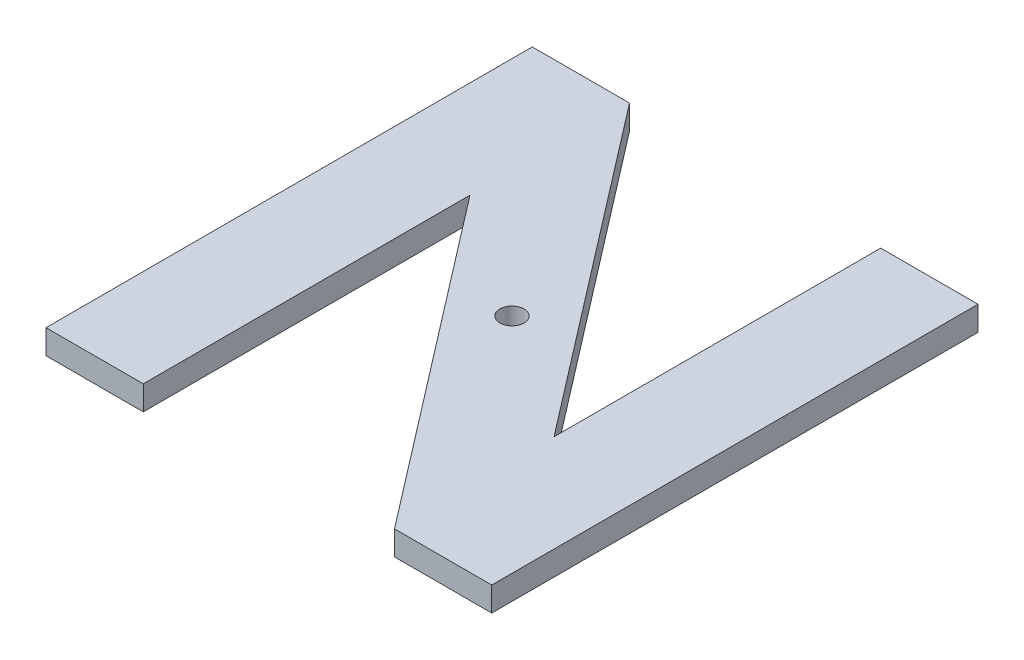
ISO-10303-21;
HEADER;
FILE_DESCRIPTION(('STEP AP214'),'2;1');
FILE_NAME('part.step','',(''),(''),'','','');
FILE_SCHEMA(('AUTOMOTIVE_DESIGN { 1 0 10303 214 1 1 1 1 }'));
ENDSEC;
DATA;
#1=APPLICATION_CONTEXT('core data for automotive mechanical design processes');
#2=APPLICATION_PROTOCOL_DEFINITION('international standard','automotive_design',2000,#1);
#3=PRODUCT_CONTEXT('',#1,'mechanical');
#4=PRODUCT('Part','Part','',(#3));
#5=PRODUCT_RELATED_PRODUCT_CATEGORY('part','',(#4));
#6=PRODUCT_DEFINITION_FORMATION('','',#4);
#7=PRODUCT_DEFINITION_CONTEXT('part definition',#1,'design');
#8=PRODUCT_DEFINITION('design','',#6,#7);
#9=PRODUCT_DEFINITION_SHAPE('','',#8);
#10=(LENGTH_UNIT() NAMED_UNIT(*) SI_UNIT(.MILLI.,.METRE.));
#11=(NAMED_UNIT(*) PLANE_ANGLE_UNIT() SI_UNIT($,.RADIAN.));
#12=(NAMED_UNIT(*) SI_UNIT($,.STERADIAN.) SOLID_ANGLE_UNIT());
#13=UNCERTAINTY_MEASURE_WITH_UNIT(LENGTH_MEASURE(1.E-05),#10,'distance_accuracy_value','');
#14=(GEOMETRIC_REPRESENTATION_CONTEXT(3) GLOBAL_UNCERTAINTY_ASSIGNED_CONTEXT((#13)) GLOBAL_UNIT_ASSIGNED_CONTEXT((#10,
#11,#12)) REPRESENTATION_CONTEXT('',''));
#15=CARTESIAN_POINT('',(0.,0.,0.));
#16=DIRECTION('',(0.,0.,1.));
#17=DIRECTION('',(1.,0.,0.));
#18=AXIS2_PLACEMENT_3D('',#15,#16,#17);
#19=CARTESIAN_POINT('',(0.,3.,-60.));
#20=DIRECTION('',(0.,-1.,0.));
#21=DIRECTION('',(0.,0.,-1.));
#22=AXIS2_PLACEMENT_3D('',#19,#20,#21);
#23=PLANE('',#22);
#24=DIRECTION('',(0.,0.,1.));
#25=VECTOR('',#24,1.);
#26=CARTESIAN_POINT('',(0.,3.,0.));
#27=LINE('',#26,#25);
#28=CARTESIAN_POINT('',(0.,3.,-60.));
#29=VERTEX_POINT('',#28);
#30=CARTESIAN_POINT('',(0.,3.,0.));
#31=VERTEX_POINT('',#30);
#32=EDGE_CURVE('E148',#29,#31,#27,.T.);
#33=ORIENTED_EDGE('',*,*,#32,.T.);
#34=DIRECTION('',(1.,0.,0.));
#35=VECTOR('',#34,1.);
#36=CARTESIAN_POINT('',(0.,3.,0.));
#37=LINE('',#36,#35);
#38=CARTESIAN_POINT('',(12.,3.,0.));
#39=VERTEX_POINT('',#38);
#40=EDGE_CURVE('E121',#31,#39,#37,.T.);
#41=ORIENTED_EDGE('',*,*,#40,.T.);
#42=DIRECTION('',(0.,0.,-1.));
#43=VECTOR('',#42,1.);
#44=CARTESIAN_POINT('',(12.,3.,0.));
#45=LINE('',#44,#43);
#46=CARTESIAN_POINT('',(12.,3.,-40.314144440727));
#47=VERTEX_POINT('',#46);
#48=EDGE_CURVE('E151',#39,#47,#45,.T.);
#49=ORIENTED_EDGE('',*,*,#48,.T.);
#50=DIRECTION('',(0.609576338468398,0.,0.792727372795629));
#51=VECTOR('',#50,1.);
#52=CARTESIAN_POINT('',(43.,3.,0.));
#53=LINE('',#52,#51);
#54=CARTESIAN_POINT('',(43.,3.,0.));
#55=VERTEX_POINT('',#54);
#56=EDGE_CURVE('E153',#47,#55,#53,.T.);
#57=ORIENTED_EDGE('',*,*,#56,.T.);
#58=DIRECTION('',(1.,0.,0.));
#59=VECTOR('',#58,1.);
#60=CARTESIAN_POINT('',(43.,3.,0.));
#61=LINE('',#60,#59);
#62=CARTESIAN_POINT('',(55.,3.,0.));
#63=VERTEX_POINT('',#62);
#64=EDGE_CURVE('E155',#55,#63,#61,.T.);
#65=ORIENTED_EDGE('',*,*,#64,.T.);
#66=DIRECTION('',(0.,0.,-1.));
#67=VECTOR('',#66,1.);
#68=CARTESIAN_POINT('',(55.,3.,0.));
#69=LINE('',#68,#67);
#70=CARTESIAN_POINT('',(55.,3.,-60.));
#71=VERTEX_POINT('',#70);
#72=EDGE_CURVE('E157',#63,#71,#69,.T.);
#73=ORIENTED_EDGE('',*,*,#72,.T.);
#74=DIRECTION('',(-1.,0.,0.));
#75=VECTOR('',#74,1.);
#76=CARTESIAN_POINT('',(43.,3.,-60.));
#77=LINE('',#76,#75);
#78=CARTESIAN_POINT('',(43.,3.,-60.));
#79=VERTEX_POINT('',#78);
#80=EDGE_CURVE('E159',#71,#79,#77,.T.);
#81=ORIENTED_EDGE('',*,*,#80,.T.);
#82=DIRECTION('',(0.,0.,1.));
#83=VECTOR('',#82,1.);
#84=CARTESIAN_POINT('',(43.,3.,-19.685855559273));
#85=LINE('',#84,#83);
#86=CARTESIAN_POINT('',(43.,3.,-19.685855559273));
#87=VERTEX_POINT('',#86);
#88=EDGE_CURVE('E161',#79,#87,#85,.T.);
#89=ORIENTED_EDGE('',*,*,#88,.T.);
#90=DIRECTION('',(-0.609576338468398,0.,-0.792727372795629));
#91=VECTOR('',#90,1.);
#92=CARTESIAN_POINT('',(12.,3.,-60.));
#93=LINE('',#92,#91);
#94=CARTESIAN_POINT('',(12.,3.,-60.));
#95=VERTEX_POINT('',#94);
#96=EDGE_CURVE('E50',#87,#95,#93,.T.);
#97=ORIENTED_EDGE('',*,*,#96,.T.);
#98=DIRECTION('',(-1.,0.,0.));
#99=VECTOR('',#98,1.);
#100=CARTESIAN_POINT('',(0.,3.,-60.));
#101=LINE('',#100,#99);
#102=EDGE_CURVE('E45',#95,#29,#101,.T.);
#103=ORIENTED_EDGE('',*,*,#102,.T.);
#104=EDGE_LOOP('',(#33,#41,#49,#57,#65,#73,#81,#89,#97,#103));
#105=FACE_BOUND('',#104,.T.);
#106=CARTESIAN_POINT('',(27.5,3.,-30.));
#107=DIRECTION('',(0.,1.,0.));
#108=DIRECTION('',(0.,0.,1.));
#109=AXIS2_PLACEMENT_3D('',#106,#107,#108);
#110=CIRCLE('',#109,1.5);
#111=CARTESIAN_POINT('',(27.5,3.,-28.5));
#112=VERTEX_POINT('',#111);
#113=EDGE_CURVE('E126',#112,#112,#110,.T.);
#114=ORIENTED_EDGE('',*,*,#113,.F.);
#115=EDGE_LOOP('',(#114));
#116=FACE_BOUND('',#115,.T.);
#117=ADVANCED_FACE('F30',(#105,#116),#23,.F.);
#118=CARTESIAN_POINT('',(0.,0.,-60.));
#119=DIRECTION('',(0.,-1.,0.));
#120=DIRECTION('',(0.,0.,-1.));
#121=AXIS2_PLACEMENT_3D('',#118,#119,#120);
#122=PLANE('',#121);
#123=DIRECTION('',(0.,0.,1.));
#124=VECTOR('',#123,1.);
#125=CARTESIAN_POINT('',(0.,0.,0.));
#126=LINE('',#125,#124);
#127=CARTESIAN_POINT('',(0.,0.,-60.));
#128=VERTEX_POINT('',#127);
#129=CARTESIAN_POINT('',(0.,0.,0.));
#130=VERTEX_POINT('',#129);
#131=EDGE_CURVE('E112',#128,#130,#126,.T.);
#132=ORIENTED_EDGE('',*,*,#131,.F.);
#133=DIRECTION('',(-1.,0.,0.));
#134=VECTOR('',#133,1.);
#135=CARTESIAN_POINT('',(0.,0.,-60.));
#136=LINE('',#135,#134);
#137=CARTESIAN_POINT('',(12.,0.,-60.));
#138=VERTEX_POINT('',#137);
#139=EDGE_CURVE('E146',#138,#128,#136,.T.);
#140=ORIENTED_EDGE('',*,*,#139,.F.);
#141=DIRECTION('',(-0.609576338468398,0.,-0.792727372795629));
#142=VECTOR('',#141,1.);
#143=CARTESIAN_POINT('',(12.,0.,-60.));
#144=LINE('',#143,#142);
#145=CARTESIAN_POINT('',(43.,0.,-19.685855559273));
#146=VERTEX_POINT('',#145);
#147=EDGE_CURVE('E144',#146,#138,#144,.T.);
#148=ORIENTED_EDGE('',*,*,#147,.F.);
#149=DIRECTION('',(0.,0.,1.));
#150=VECTOR('',#149,1.);
#151=CARTESIAN_POINT('',(43.,0.,-19.685855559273));
#152=LINE('',#151,#150);
#153=CARTESIAN_POINT('',(43.,0.,-60.));
#154=VERTEX_POINT('',#153);
#155=EDGE_CURVE('E142',#154,#146,#152,.T.);
#156=ORIENTED_EDGE('',*,*,#155,.F.);
#157=DIRECTION('',(-1.,0.,0.));
#158=VECTOR('',#157,1.);
#159=CARTESIAN_POINT('',(43.,0.,-60.));
#160=LINE('',#159,#158);
#161=CARTESIAN_POINT('',(55.,0.,-60.));
#162=VERTEX_POINT('',#161);
#163=EDGE_CURVE('E140',#162,#154,#160,.T.);
#164=ORIENTED_EDGE('',*,*,#163,.F.);
#165=DIRECTION('',(0.,0.,-1.));
#166=VECTOR('',#165,1.);
#167=CARTESIAN_POINT('',(55.,0.,0.));
#168=LINE('',#167,#166);
#169=CARTESIAN_POINT('',(55.,0.,0.));
#170=VERTEX_POINT('',#169);
#171=EDGE_CURVE('E138',#170,#162,#168,.T.);
#172=ORIENTED_EDGE('',*,*,#171,.F.);
#173=DIRECTION('',(1.,0.,0.));
#174=VECTOR('',#173,1.);
#175=CARTESIAN_POINT('',(43.,0.,0.));
#176=LINE('',#175,#174);
#177=CARTESIAN_POINT('',(43.,0.,0.));
#178=VERTEX_POINT('',#177);
#179=EDGE_CURVE('E136',#178,#170,#176,.T.);
#180=ORIENTED_EDGE('',*,*,#179,.F.);
#181=DIRECTION('',(0.609576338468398,0.,0.792727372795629));
#182=VECTOR('',#181,1.);
#183=CARTESIAN_POINT('',(43.,0.,0.));
#184=LINE('',#183,#182);
#185=CARTESIAN_POINT('',(12.,0.,-40.314144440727));
#186=VERTEX_POINT('',#185);
#187=EDGE_CURVE('E134',#186,#178,#184,.T.);
#188=ORIENTED_EDGE('',*,*,#187,.F.);
#189=DIRECTION('',(0.,0.,-1.));
#190=VECTOR('',#189,1.);
#191=CARTESIAN_POINT('',(12.,0.,0.));
#192=LINE('',#191,#190);
#193=CARTESIAN_POINT('',(12.,0.,0.));
#194=VERTEX_POINT('',#193);
#195=EDGE_CURVE('E114',#194,#186,#192,.T.);
#196=ORIENTED_EDGE('',*,*,#195,.F.);
#197=DIRECTION('',(1.,0.,0.));
#198=VECTOR('',#197,1.);
#199=CARTESIAN_POINT('',(0.,0.,0.));
#200=LINE('',#199,#198);
#201=EDGE_CURVE('E107',#130,#194,#200,.T.);
#202=ORIENTED_EDGE('',*,*,#201,.F.);
#203=EDGE_LOOP('',(#132,#140,#148,#156,#164,#172,#180,#188,#196,#202));
#204=FACE_BOUND('',#203,.T.);
#205=CARTESIAN_POINT('',(27.5,0.,-30.));
#206=DIRECTION('',(0.,1.,0.));
#207=DIRECTION('',(0.,0.,1.));
#208=AXIS2_PLACEMENT_3D('',#205,#206,#207);
#209=CIRCLE('',#208,1.5);
#210=CARTESIAN_POINT('',(27.5,0.,-28.5));
#211=VERTEX_POINT('',#210);
#212=EDGE_CURVE('E129',#211,#211,#209,.T.);
#213=ORIENTED_EDGE('',*,*,#212,.T.);
#214=EDGE_LOOP('',(#213));
#215=FACE_BOUND('',#214,.T.);
#216=ADVANCED_FACE('F108',(#204,#215),#122,.T.);
#217=CARTESIAN_POINT('',(0.,3.,0.));
#218=DIRECTION('',(1.,0.,0.));
#219=DIRECTION('',(0.,0.,-1.));
#220=AXIS2_PLACEMENT_3D('',#217,#218,#219);
#221=PLANE('',#220);
#222=ORIENTED_EDGE('',*,*,#131,.T.);
#223=DIRECTION('',(0.,-1.,0.));
#224=VECTOR('',#223,1.);
#225=CARTESIAN_POINT('',(0.,3.,0.));
#226=LINE('',#225,#224);
#227=EDGE_CURVE('E11',#31,#130,#226,.T.);
#228=ORIENTED_EDGE('',*,*,#227,.F.);
#229=ORIENTED_EDGE('',*,*,#32,.F.);
#230=DIRECTION('',(0.,-1.,0.));
#231=VECTOR('',#230,1.);
#232=CARTESIAN_POINT('',(0.,3.,-60.));
#233=LINE('',#232,#231);
#234=EDGE_CURVE('E125',#29,#128,#233,.T.);
#235=ORIENTED_EDGE('',*,*,#234,.T.);
#236=EDGE_LOOP('',(#222,#228,#229,#235));
#237=FACE_BOUND('',#236,.T.);
#238=ADVANCED_FACE('F32',(#237),#221,.F.);
#239=CARTESIAN_POINT('',(0.,3.,0.));
#240=DIRECTION('',(0.,0.,-1.));
#241=DIRECTION('',(-1.,0.,0.));
#242=AXIS2_PLACEMENT_3D('',#239,#240,#241);
#243=PLANE('',#242);
#244=ORIENTED_EDGE('',*,*,#201,.T.);
#245=DIRECTION('',(0.,-1.,0.));
#246=VECTOR('',#245,1.);
#247=CARTESIAN_POINT('',(12.,3.,0.));
#248=LINE('',#247,#246);
#249=EDGE_CURVE('E38',#39,#194,#248,.T.);
#250=ORIENTED_EDGE('',*,*,#249,.F.);
#251=ORIENTED_EDGE('',*,*,#40,.F.);
#252=ORIENTED_EDGE('',*,*,#227,.T.);
#253=EDGE_LOOP('',(#244,#250,#251,#252));
#254=FACE_BOUND('',#253,.T.);
#255=ADVANCED_FACE('F120',(#254),#243,.F.);
#256=CARTESIAN_POINT('',(12.,3.,0.));
#257=DIRECTION('',(-1.,0.,0.));
#258=DIRECTION('',(0.,0.,1.));
#259=AXIS2_PLACEMENT_3D('',#256,#257,#258);
#260=PLANE('',#259);
#261=ORIENTED_EDGE('',*,*,#195,.T.);
#262=DIRECTION('',(0.,-1.,0.));
#263=VECTOR('',#262,1.);
#264=CARTESIAN_POINT('',(12.,3.,-40.314144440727));
#265=LINE('',#264,#263);
#266=EDGE_CURVE('E184',#47,#186,#265,.T.);
#267=ORIENTED_EDGE('',*,*,#266,.F.);
#268=ORIENTED_EDGE('',*,*,#48,.F.);
#269=ORIENTED_EDGE('',*,*,#249,.T.);
#270=EDGE_LOOP('',(#261,#267,#268,#269));
#271=FACE_BOUND('',#270,.T.);
#272=ADVANCED_FACE('F188',(#271),#260,.F.);
#273=CARTESIAN_POINT('',(43.,3.,0.));
#274=DIRECTION('',(0.792727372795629,0.,-0.609576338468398));
#275=DIRECTION('',(-0.609576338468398,0.,-0.792727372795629));
#276=AXIS2_PLACEMENT_3D('',#273,#274,#275);
#277=PLANE('',#276);
#278=ORIENTED_EDGE('',*,*,#187,.T.);
#279=DIRECTION('',(0.,-1.,0.));
#280=VECTOR('',#279,1.);
#281=CARTESIAN_POINT('',(43.,3.,0.));
#282=LINE('',#281,#280);
#283=EDGE_CURVE('E181',#55,#178,#282,.T.);
#284=ORIENTED_EDGE('',*,*,#283,.F.);
#285=ORIENTED_EDGE('',*,*,#56,.F.);
#286=ORIENTED_EDGE('',*,*,#266,.T.);
#287=EDGE_LOOP('',(#278,#284,#285,#286));
#288=FACE_BOUND('',#287,.T.);
#289=ADVANCED_FACE('F196',(#288),#277,.F.);
#290=CARTESIAN_POINT('',(43.,3.,0.));
#291=DIRECTION('',(0.,0.,-1.));
#292=DIRECTION('',(-1.,0.,0.));
#293=AXIS2_PLACEMENT_3D('',#290,#291,#292);
#294=PLANE('',#293);
#295=ORIENTED_EDGE('',*,*,#179,.T.);
#296=DIRECTION('',(0.,-1.,0.));
#297=VECTOR('',#296,1.);
#298=CARTESIAN_POINT('',(55.,3.,0.));
#299=LINE('',#298,#297);
#300=EDGE_CURVE('E178',#63,#170,#299,.T.);
#301=ORIENTED_EDGE('',*,*,#300,.F.);
#302=ORIENTED_EDGE('',*,*,#64,.F.);
#303=ORIENTED_EDGE('',*,*,#283,.T.);
#304=EDGE_LOOP('',(#295,#301,#302,#303));
#305=FACE_BOUND('',#304,.T.);
#306=ADVANCED_FACE('F199',(#305),#294,.F.);
#307=CARTESIAN_POINT('',(55.,3.,0.));
#308=DIRECTION('',(-1.,0.,0.));
#309=DIRECTION('',(0.,0.,1.));
#310=AXIS2_PLACEMENT_3D('',#307,#308,#309);
#311=PLANE('',#310);
#312=ORIENTED_EDGE('',*,*,#171,.T.);
#313=DIRECTION('',(0.,-1.,0.));
#314=VECTOR('',#313,1.);
#315=CARTESIAN_POINT('',(55.,3.,-60.));
#316=LINE('',#315,#314);
#317=EDGE_CURVE('E175',#71,#162,#316,.T.);
#318=ORIENTED_EDGE('',*,*,#317,.F.);
#319=ORIENTED_EDGE('',*,*,#72,.F.);
#320=ORIENTED_EDGE('',*,*,#300,.T.);
#321=EDGE_LOOP('',(#312,#318,#319,#320));
#322=FACE_BOUND('',#321,.T.);
#323=ADVANCED_FACE('F204',(#322),#311,.F.);
#324=CARTESIAN_POINT('',(43.,3.,-60.));
#325=DIRECTION('',(0.,0.,1.));
#326=DIRECTION('',(1.,0.,0.));
#327=AXIS2_PLACEMENT_3D('',#324,#325,#326);
#328=PLANE('',#327);
#329=ORIENTED_EDGE('',*,*,#163,.T.);
#330=DIRECTION('',(0.,-1.,0.));
#331=VECTOR('',#330,1.);
#332=CARTESIAN_POINT('',(43.,3.,-60.));
#333=LINE('',#332,#331);
#334=EDGE_CURVE('E172',#79,#154,#333,.T.);
#335=ORIENTED_EDGE('',*,*,#334,.F.);
#336=ORIENTED_EDGE('',*,*,#80,.F.);
#337=ORIENTED_EDGE('',*,*,#317,.T.);
#338=EDGE_LOOP('',(#329,#335,#336,#337));
#339=FACE_BOUND('',#338,.T.);
#340=ADVANCED_FACE('F210',(#339),#328,.F.);
#341=CARTESIAN_POINT('',(43.,3.,-19.685855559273));
#342=DIRECTION('',(1.,0.,0.));
#343=DIRECTION('',(0.,0.,-1.));
#344=AXIS2_PLACEMENT_3D('',#341,#342,#343);
#345=PLANE('',#344);
#346=ORIENTED_EDGE('',*,*,#155,.T.);
#347=DIRECTION('',(0.,-1.,0.));
#348=VECTOR('',#347,1.);
#349=CARTESIAN_POINT('',(43.,3.,-19.685855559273));
#350=LINE('',#349,#348);
#351=EDGE_CURVE('E169',#87,#146,#350,.T.);
#352=ORIENTED_EDGE('',*,*,#351,.F.);
#353=ORIENTED_EDGE('',*,*,#88,.F.);
#354=ORIENTED_EDGE('',*,*,#334,.T.);
#355=EDGE_LOOP('',(#346,#352,#353,#354));
#356=FACE_BOUND('',#355,.T.);
#357=ADVANCED_FACE('F214',(#356),#345,.F.);
#358=CARTESIAN_POINT('',(12.,3.,-60.));
#359=DIRECTION('',(-0.792727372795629,0.,0.609576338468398));
#360=DIRECTION('',(0.609576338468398,0.,0.792727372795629));
#361=AXIS2_PLACEMENT_3D('',#358,#359,#360);
#362=PLANE('',#361);
#363=ORIENTED_EDGE('',*,*,#147,.T.);
#364=DIRECTION('',(0.,-1.,0.));
#365=VECTOR('',#364,1.);
#366=CARTESIAN_POINT('',(12.,3.,-60.));
#367=LINE('',#366,#365);
#368=EDGE_CURVE('E166',#95,#138,#367,.T.);
#369=ORIENTED_EDGE('',*,*,#368,.F.);
#370=ORIENTED_EDGE('',*,*,#96,.F.);
#371=ORIENTED_EDGE('',*,*,#351,.T.);
#372=EDGE_LOOP('',(#363,#369,#370,#371));
#373=FACE_BOUND('',#372,.T.);
#374=ADVANCED_FACE('F217',(#373),#362,.F.);
#375=CARTESIAN_POINT('',(0.,3.,-60.));
#376=DIRECTION('',(0.,0.,1.));
#377=DIRECTION('',(1.,0.,0.));
#378=AXIS2_PLACEMENT_3D('',#375,#376,#377);
#379=PLANE('',#378);
#380=ORIENTED_EDGE('',*,*,#139,.T.);
#381=ORIENTED_EDGE('',*,*,#234,.F.);
#382=ORIENTED_EDGE('',*,*,#102,.F.);
#383=ORIENTED_EDGE('',*,*,#368,.T.);
#384=EDGE_LOOP('',(#380,#381,#382,#383));
#385=FACE_BOUND('',#384,.T.);
#386=ADVANCED_FACE('F219',(#385),#379,.F.);
#387=CARTESIAN_POINT('',(27.5,3.,-30.));
#388=DIRECTION('',(0.,-1.,0.));
#389=DIRECTION('',(0.,0.,-1.));
#390=AXIS2_PLACEMENT_3D('',#387,#388,#389);
#391=CYLINDRICAL_SURFACE('',#390,1.5);
#392=ORIENTED_EDGE('',*,*,#113,.T.);
#393=EDGE_LOOP('',(#392));
#394=FACE_BOUND('',#393,.T.);
#395=ORIENTED_EDGE('',*,*,#212,.F.);
#396=EDGE_LOOP('',(#395));
#397=FACE_BOUND('',#396,.T.);
#398=ADVANCED_FACE('F221',(#394,#397),#391,.F.);
#399=CLOSED_SHELL('',(#117,#216,#238,#255,#272,#289,#306,#323,#340,#357,#374,#386,#398));
#400=MANIFOLD_SOLID_BREP('B2',#399);
#401=ADVANCED_BREP_SHAPE_REPRESENTATION('',(#18,#400),#14);
#402=SHAPE_DEFINITION_REPRESENTATION(#9,#401);
ENDSEC;
END-ISO-10303-21;
